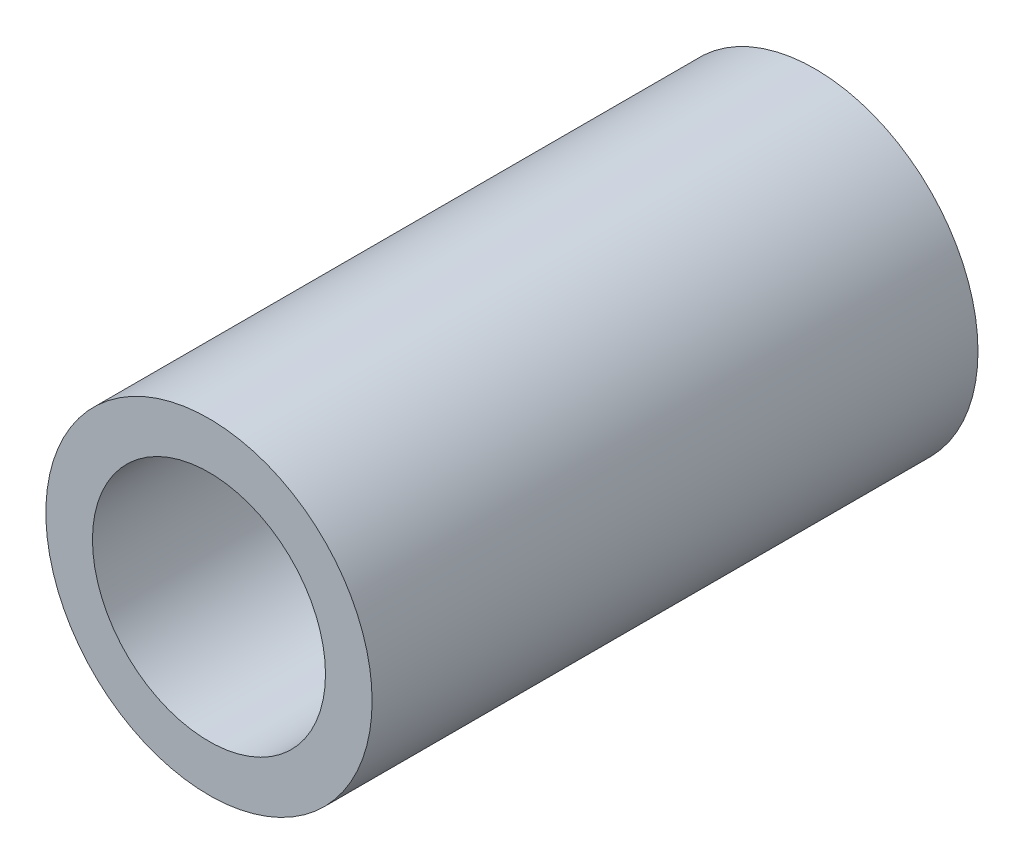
from build123d import *

# Parameters (mm, degrees)
ESQUISSE1_R        = 7
ESQUISSE1_R_2      = 5
EXTRU_MINCE1_DEPTH = 26


with BuildPart() as part:
    # Esquisse1 → Extru.-Mince1 (new body)
    with BuildSketch(Plane.XY):
        Circle(ESQUISSE1_R)
        Circle(ESQUISSE1_R_2, mode=Mode.SUBTRACT)
    extrude(amount=EXTRU_MINCE1_DEPTH)


solid = part.part
